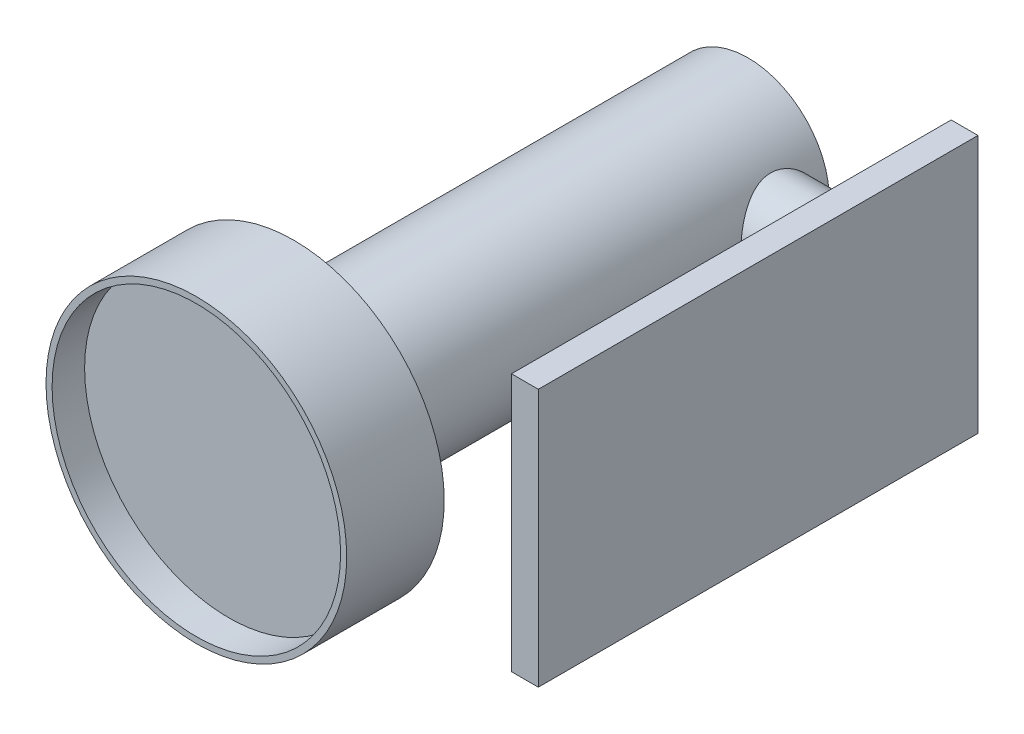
ISO-10303-21;
HEADER;
FILE_DESCRIPTION(('STEP AP214'),'2;1');
FILE_NAME('part.step','',(''),(''),'','','');
FILE_SCHEMA(('AUTOMOTIVE_DESIGN { 1 0 10303 214 1 1 1 1 }'));
ENDSEC;
DATA;
#1=APPLICATION_CONTEXT('core data for automotive mechanical design processes');
#2=APPLICATION_PROTOCOL_DEFINITION('international standard','automotive_design',2000,#1);
#3=PRODUCT_CONTEXT('',#1,'mechanical');
#4=PRODUCT('Part','Part','',(#3));
#5=PRODUCT_RELATED_PRODUCT_CATEGORY('part','',(#4));
#6=PRODUCT_DEFINITION_FORMATION('','',#4);
#7=PRODUCT_DEFINITION_CONTEXT('part definition',#1,'design');
#8=PRODUCT_DEFINITION('design','',#6,#7);
#9=PRODUCT_DEFINITION_SHAPE('','',#8);
#10=(LENGTH_UNIT() NAMED_UNIT(*) SI_UNIT(.MILLI.,.METRE.));
#11=(NAMED_UNIT(*) PLANE_ANGLE_UNIT() SI_UNIT($,.RADIAN.));
#12=(NAMED_UNIT(*) SI_UNIT($,.STERADIAN.) SOLID_ANGLE_UNIT());
#13=UNCERTAINTY_MEASURE_WITH_UNIT(LENGTH_MEASURE(1.E-05),#10,'distance_accuracy_value','');
#14=(GEOMETRIC_REPRESENTATION_CONTEXT(3) GLOBAL_UNCERTAINTY_ASSIGNED_CONTEXT((#13)) GLOBAL_UNIT_ASSIGNED_CONTEXT((#10,
#11,#12)) REPRESENTATION_CONTEXT('',''));
#15=CARTESIAN_POINT('',(0.,0.,0.));
#16=DIRECTION('',(0.,0.,1.));
#17=DIRECTION('',(1.,0.,0.));
#18=AXIS2_PLACEMENT_3D('',#15,#16,#17);
#19=CARTESIAN_POINT('',(0.,0.,-55.88));
#20=DIRECTION('',(0.,0.,1.));
#21=DIRECTION('',(1.,0.,0.));
#22=AXIS2_PLACEMENT_3D('',#19,#20,#21);
#23=CYLINDRICAL_SURFACE('',#22,10.);
#24=CARTESIAN_POINT('',(0.,0.,-55.88));
#25=DIRECTION('',(0.,0.,-1.));
#26=DIRECTION('',(-1.,0.,0.));
#27=AXIS2_PLACEMENT_3D('',#24,#25,#26);
#28=CIRCLE('',#27,10.);
#29=CARTESIAN_POINT('',(-10.,0.,-55.88));
#30=VERTEX_POINT('',#29);
#31=EDGE_CURVE('E125',#30,#30,#28,.T.);
#32=ORIENTED_EDGE('',*,*,#31,.F.);
#33=EDGE_LOOP('',(#32));
#34=FACE_BOUND('',#33,.T.);
#35=CARTESIAN_POINT('',(0.,0.,0.));
#36=DIRECTION('',(0.,0.,-1.));
#37=DIRECTION('',(-1.,0.,0.));
#38=AXIS2_PLACEMENT_3D('',#35,#36,#37);
#39=CIRCLE('',#38,10.);
#40=CARTESIAN_POINT('',(-10.,0.,0.));
#41=VERTEX_POINT('',#40);
#42=EDGE_CURVE('E53',#41,#41,#39,.T.);
#43=ORIENTED_EDGE('',*,*,#42,.T.);
#44=EDGE_LOOP('',(#43));
#45=FACE_BOUND('',#44,.T.);
#46=CARTESIAN_POINT('',(10.,0.,-55.0046272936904));
#47=CARTESIAN_POINT('',(9.99999960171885,0.131488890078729,-55.0046268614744));
#48=CARTESIAN_POINT('',(9.99740053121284,0.262986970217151,-54.9994345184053));
#49=CARTESIAN_POINT('',(9.98706977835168,0.525014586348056,-54.9787243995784));
#50=CARTESIAN_POINT('',(9.97933586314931,0.655543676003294,-54.9632021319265));
#51=CARTESIAN_POINT('',(9.95892066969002,0.914783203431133,-54.9219865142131));
#52=CARTESIAN_POINT('',(9.94623233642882,1.04349077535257,-54.8962786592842));
#53=CARTESIAN_POINT('',(9.91622716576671,1.29802636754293,-54.834976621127));
#54=CARTESIAN_POINT('',(9.89890843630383,1.42385318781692,-54.7993783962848));
#55=CARTESIAN_POINT('',(9.86015430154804,1.67121386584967,-54.7188488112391));
#56=CARTESIAN_POINT('',(9.83873709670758,1.79276399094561,-54.6739586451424));
#57=CARTESIAN_POINT('',(9.79224427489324,2.0314444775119,-54.5751784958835));
#58=CARTESIAN_POINT('',(9.7671672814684,2.14857315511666,-54.521285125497));
#59=CARTESIAN_POINT('',(9.68730860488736,2.49222561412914,-54.3468276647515));
#60=CARTESIAN_POINT('',(9.6278546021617,2.71128846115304,-54.2133965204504));
#61=CARTESIAN_POINT('',(9.49780663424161,3.13758045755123,-53.9070220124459));
#62=CARTESIAN_POINT('',(9.42675632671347,3.34329192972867,-53.7321766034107));
#63=CARTESIAN_POINT('',(9.28300214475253,3.72388133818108,-53.3520382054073));
#64=CARTESIAN_POINT('',(9.21029705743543,3.89873577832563,-53.1467222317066));
#65=CARTESIAN_POINT('',(9.06493867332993,4.22628385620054,-52.6921521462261));
#66=CARTESIAN_POINT('',(8.99272664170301,4.37620734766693,-52.4407254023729));
#67=CARTESIAN_POINT('',(8.89637417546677,4.56723365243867,-52.0447092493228));
#68=CARTESIAN_POINT('',(8.86624279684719,4.62527981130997,-51.9095090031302));
#69=CARTESIAN_POINT('',(8.81109611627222,4.72948843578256,-51.6336260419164));
#70=CARTESIAN_POINT('',(8.78607778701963,4.77565793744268,-51.4929466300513));
#71=CARTESIAN_POINT('',(8.74350562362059,4.85313805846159,-51.2156345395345));
#72=CARTESIAN_POINT('',(8.72559704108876,4.88516762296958,-51.0792568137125));
#73=CARTESIAN_POINT('',(8.69596333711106,4.93772573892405,-50.8037015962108));
#74=CARTESIAN_POINT('',(8.68423493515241,4.95826039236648,-50.6645256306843));
#75=CARTESIAN_POINT('',(8.66746161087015,4.98752398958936,-50.3846198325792));
#76=CARTESIAN_POINT('',(8.66241266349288,4.99626004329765,-50.2438909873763));
#77=CARTESIAN_POINT('',(8.65921299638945,5.00180399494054,-49.9621261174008));
#78=CARTESIAN_POINT('',(8.66106161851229,4.99861303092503,-49.8210901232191));
#79=CARTESIAN_POINT('',(8.67093727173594,4.98145803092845,-49.5569237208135));
#80=CARTESIAN_POINT('',(8.67819663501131,4.96883208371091,-49.4336746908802));
#81=CARTESIAN_POINT('',(8.69773906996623,4.93454402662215,-49.1888060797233));
#82=CARTESIAN_POINT('',(8.71002371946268,4.91287907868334,-49.0671870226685));
#83=CARTESIAN_POINT('',(8.73921479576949,4.86076278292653,-48.8264294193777));
#84=CARTESIAN_POINT('',(8.75612065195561,4.83031251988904,-48.7072905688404));
#85=CARTESIAN_POINT('',(8.79403073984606,4.76094319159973,-48.472155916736));
#86=CARTESIAN_POINT('',(8.81503658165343,4.72202079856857,-48.3561613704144));
#87=CARTESIAN_POINT('',(8.88436032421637,4.59108661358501,-48.0086204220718));
#88=CARTESIAN_POINT('',(8.93828791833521,4.48608785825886,-47.7829339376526));
#89=CARTESIAN_POINT('',(9.05517433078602,4.24519591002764,-47.3514171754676));
#90=CARTESIAN_POINT('',(9.11813720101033,4.10928884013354,-47.1455958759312));
#91=CARTESIAN_POINT('',(9.2556545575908,3.79034422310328,-46.7320387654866));
#92=CARTESIAN_POINT('',(9.33066654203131,3.60351571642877,-46.5273692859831));
#93=CARTESIAN_POINT('',(9.47739013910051,3.19773444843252,-46.1509238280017));
#94=CARTESIAN_POINT('',(9.54910016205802,2.97876642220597,-45.9791635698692));
#95=CARTESIAN_POINT('',(9.65034506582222,2.62430600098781,-45.7461863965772));
#96=CARTESIAN_POINT('',(9.68370380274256,2.49871002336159,-45.6712751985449));
#97=CARTESIAN_POINT('',(9.74663052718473,2.2407106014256,-45.532419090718));
#98=CARTESIAN_POINT('',(9.77620011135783,2.10831005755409,-45.4684695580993));
#99=CARTESIAN_POINT('',(9.83067553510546,1.83762803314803,-45.352228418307));
#100=CARTESIAN_POINT('',(9.85558325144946,1.69934894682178,-45.2999321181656));
#101=CARTESIAN_POINT('',(9.89999026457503,1.41791187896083,-45.2076023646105));
#102=CARTESIAN_POINT('',(9.91949018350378,1.27475446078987,-45.1675675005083));
#103=CARTESIAN_POINT('',(9.95109597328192,0.996798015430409,-45.1030937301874));
#104=CARTESIAN_POINT('',(9.96368046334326,0.862288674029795,-45.077637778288));
#105=CARTESIAN_POINT('',(9.98343035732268,0.591248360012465,-45.0378192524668));
#106=CARTESIAN_POINT('',(9.99059624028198,0.45471756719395,-45.0234556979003));
#107=CARTESIAN_POINT('',(9.99930380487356,0.180810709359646,-45.0060141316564));
#108=CARTESIAN_POINT('',(10.000847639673,0.0434349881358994,-45.0029317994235));
#109=CARTESIAN_POINT('',(9.99827237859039,-0.23104760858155,-45.0080828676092));
#110=CARTESIAN_POINT('',(9.99415353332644,-0.36815449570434,-45.0163157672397));
#111=CARTESIAN_POINT('',(9.98090973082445,-0.630324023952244,-45.0429059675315));
#112=CARTESIAN_POINT('',(9.97219922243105,-0.755493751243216,-45.0604256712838));
#113=CARTESIAN_POINT('',(9.95027227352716,-1.00380426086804,-45.104801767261));
#114=CARTESIAN_POINT('',(9.93705440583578,-1.12694438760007,-45.1316611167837));
#115=CARTESIAN_POINT('',(9.90642450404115,-1.37032307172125,-45.1944299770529));
#116=CARTESIAN_POINT('',(9.88901375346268,-1.49056250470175,-45.2303367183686));
#117=CARTESIAN_POINT('',(9.85039368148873,-1.72747946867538,-45.3108554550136));
#118=CARTESIAN_POINT('',(9.82918290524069,-1.84415561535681,-45.3554707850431));
#119=CARTESIAN_POINT('',(9.75922876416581,-2.19430354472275,-45.5045751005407));
#120=CARTESIAN_POINT('',(9.70504904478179,-2.42111320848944,-45.6225680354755));
#121=CARTESIAN_POINT('',(9.58719375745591,-2.8523456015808,-45.8901794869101));
#122=CARTESIAN_POINT('',(9.5235141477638,-3.05675873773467,-46.0398114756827));
#123=CARTESIAN_POINT('',(9.38541505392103,-3.45882132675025,-46.3834145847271));
#124=CARTESIAN_POINT('',(9.31055499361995,-3.65383533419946,-46.5802968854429));
#125=CARTESIAN_POINT('',(9.16310881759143,-4.00930667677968,-47.0042978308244));
#126=CARTESIAN_POINT('',(9.09052430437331,-4.16974010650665,-47.2314372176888));
#127=CARTESIAN_POINT('',(8.98785260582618,-4.38466016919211,-47.5971178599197));
#128=CARTESIAN_POINT('',(8.95395955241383,-4.4532676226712,-47.7264781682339));
#129=CARTESIAN_POINT('',(8.89022352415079,-4.57918112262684,-47.9915213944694));
#130=CARTESIAN_POINT('',(8.86037871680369,-4.63649228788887,-48.1272014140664));
#131=CARTESIAN_POINT('',(8.80590327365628,-4.73913999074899,-48.4039043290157));
#132=CARTESIAN_POINT('',(8.78126837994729,-4.78448631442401,-48.5449227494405));
#133=CARTESIAN_POINT('',(8.73822819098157,-4.86265004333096,-48.8313183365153));
#134=CARTESIAN_POINT('',(8.7198219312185,-4.89546938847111,-48.976694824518));
#135=CARTESIAN_POINT('',(8.69151275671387,-4.94553834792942,-49.2563922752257));
#136=CARTESIAN_POINT('',(8.6809632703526,-4.96397997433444,-49.3904351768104));
#137=CARTESIAN_POINT('',(8.66606824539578,-4.98993873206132,-49.6599125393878));
#138=CARTESIAN_POINT('',(8.66172205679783,-4.99745700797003,-49.7953468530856));
#139=CARTESIAN_POINT('',(8.65941425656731,-5.00145477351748,-50.0663842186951));
#140=CARTESIAN_POINT('',(8.66145040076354,-4.99793814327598,-50.20198719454));
#141=CARTESIAN_POINT('',(8.67181681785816,-4.97992974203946,-50.4722128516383));
#142=CARTESIAN_POINT('',(8.68014683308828,-4.96543842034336,-50.606835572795));
#143=CARTESIAN_POINT('',(8.70167828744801,-4.92759757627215,-50.8611874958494));
#144=CARTESIAN_POINT('',(8.71433770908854,-4.90522766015,-50.9811098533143));
#145=CARTESIAN_POINT('',(8.74411599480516,-4.85194376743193,-51.2184884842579));
#146=CARTESIAN_POINT('',(8.76123623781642,-4.82102714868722,-51.3359439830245));
#147=CARTESIAN_POINT('',(8.81854231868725,-4.71590306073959,-51.6835444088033));
#148=CARTESIAN_POINT('',(8.86468813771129,-4.62929708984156,-51.9090833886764));
#149=CARTESIAN_POINT('',(8.97142890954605,-4.41907164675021,-52.3577876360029));
#150=CARTESIAN_POINT('',(9.03278633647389,-4.29335633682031,-52.5797753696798));
#151=CARTESIAN_POINT('',(9.1617663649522,-4.01075421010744,-53.0009914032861));
#152=CARTESIAN_POINT('',(9.22939221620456,-3.85385117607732,-53.2002077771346));
#153=CARTESIAN_POINT('',(9.37311444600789,-3.49102748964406,-53.5953351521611));
#154=CARTESIAN_POINT('',(9.44924162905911,-3.28146736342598,-53.787903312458));
#155=CARTESIAN_POINT('',(9.59389514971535,-2.83072875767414,-54.1359617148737));
#156=CARTESIAN_POINT('',(9.66241737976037,-2.58953334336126,-54.291431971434));
#157=CARTESIAN_POINT('',(9.7541901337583,-2.20753881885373,-54.4932577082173));
#158=CARTESIAN_POINT('',(9.78304209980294,-2.0762551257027,-54.5554943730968));
#159=CARTESIAN_POINT('',(9.83614745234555,-1.80799529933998,-54.6685634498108));
#160=CARTESIAN_POINT('',(9.8604030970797,-1.67102200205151,-54.719401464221));
#161=CARTESIAN_POINT('',(9.90354484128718,-1.39269501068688,-54.8089727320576));
#162=CARTESIAN_POINT('',(9.92244264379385,-1.25135162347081,-54.8477323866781));
#163=CARTESIAN_POINT('',(9.95434618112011,-0.965237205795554,-54.912764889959));
#164=CARTESIAN_POINT('',(9.96735551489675,-0.82046832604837,-54.9390453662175));
#165=CARTESIAN_POINT('',(9.98476387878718,-0.563041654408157,-54.9741018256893));
#166=CARTESIAN_POINT('',(9.99046741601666,-0.450825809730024,-54.9855390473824));
#167=CARTESIAN_POINT('',(9.99808569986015,-0.225742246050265,-55.0008020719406));
#168=CARTESIAN_POINT('',(10.000000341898,-0.112874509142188,-55.0046276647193));
#169=CARTESIAN_POINT('',(10.,0.,-55.0046272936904));
#170=B_SPLINE_CURVE_WITH_KNOTS('',3,(#46,#47,#48,#49,#50,#51,#52,#53,#54,#55,#56,#57,#58,#59,
#60,#61,#62,#63,#64,#65,#66,#67,#68,#69,#70,#71,#72,#73,#74,#75,#76,#77,#78,#79,#80,#81,#82,#83,
#84,#85,#86,#87,#88,#89,#90,#91,#92,#93,#94,#95,#96,#97,#98,#99,#100,#101,#102,#103,#104,#105,
#106,#107,#108,#109,#110,#111,#112,#113,#114,#115,#116,#117,#118,#119,#120,#121,#122,#123,#124,
#125,#126,#127,#128,#129,#130,#131,#132,#133,#134,#135,#136,#137,#138,#139,#140,#141,#142,#143,
#144,#145,#146,#147,#148,#149,#150,#151,#152,#153,#154,#155,#156,#157,#158,#159,#160,#161,#162,
#163,#164,#165,#166,#167,#168,#169),.UNSPECIFIED.,.T.,.F.,(4,2,2,2,2,2,2,2,2,2,2,2,2,2,2,2,2,2,
2,2,2,2,2,2,2,2,2,2,2,2,2,2,2,2,2,2,2,2,2,2,2,2,2,2,2,2,2,2,2,2,2,2,2,2,2,2,2,2,2,2,2,4),(0.,
0.39435529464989,0.788882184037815,1.18397293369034,1.57922537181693,1.97276168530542,
2.36644639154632,3.15295441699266,3.98704440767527,4.821766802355,5.72122193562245,
6.17125359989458,6.62101803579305,7.04410338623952,7.46696393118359,7.88956954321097,
8.3121348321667,8.68401534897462,9.05601271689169,9.42796417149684,9.80006198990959,
10.56083380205,11.3219478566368,12.1795688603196,13.03759852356,13.4870830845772,
13.9363776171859,14.3854908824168,14.8345524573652,15.2464230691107,15.6582572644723,
16.0699337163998,16.4815919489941,16.8612200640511,17.240968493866,17.6206008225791,
18.0003788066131,18.7808755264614,19.5617052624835,20.4192132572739,21.2773121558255,
21.7277011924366,22.1778856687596,22.6277007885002,23.0774462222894,23.4840267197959,
23.8905646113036,24.2969595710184,24.703337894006,25.0708552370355,25.4384863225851,
26.1732662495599,26.9574126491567,27.7419678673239,28.6218519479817,29.5022089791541,
29.9460734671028,30.3897193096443,30.8323885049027,31.2747867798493,31.6133053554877,
31.9518332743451),.UNSPECIFIED.);
#171=CARTESIAN_POINT('',(10.,0.,-55.0046272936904));
#172=VERTEX_POINT('',#171);
#173=EDGE_CURVE('E11',#172,#172,#170,.T.);
#174=ORIENTED_EDGE('',*,*,#173,.F.);
#175=EDGE_LOOP('',(#174));
#176=FACE_BOUND('',#175,.T.);
#177=ADVANCED_FACE('F39',(#34,#45,#176),#23,.T.);
#178=CARTESIAN_POINT('',(0.,0.,12.));
#179=DIRECTION('',(0.,0.,-1.));
#180=DIRECTION('',(-1.,0.,0.));
#181=AXIS2_PLACEMENT_3D('',#178,#179,#180);
#182=CYLINDRICAL_SURFACE('',#181,18.5);
#183=CARTESIAN_POINT('',(0.,0.,12.));
#184=DIRECTION('',(0.,0.,1.));
#185=DIRECTION('',(1.,0.,0.));
#186=AXIS2_PLACEMENT_3D('',#183,#184,#185);
#187=CIRCLE('',#186,18.5);
#188=CARTESIAN_POINT('',(18.5,0.,12.));
#189=VERTEX_POINT('',#188);
#190=EDGE_CURVE('E131',#189,#189,#187,.T.);
#191=ORIENTED_EDGE('',*,*,#190,.F.);
#192=EDGE_LOOP('',(#191));
#193=FACE_BOUND('',#192,.T.);
#194=CARTESIAN_POINT('',(0.,0.,0.));
#195=DIRECTION('',(0.,0.,1.));
#196=DIRECTION('',(1.,0.,0.));
#197=AXIS2_PLACEMENT_3D('',#194,#195,#196);
#198=CIRCLE('',#197,18.5);
#199=CARTESIAN_POINT('',(18.5,0.,0.));
#200=VERTEX_POINT('',#199);
#201=EDGE_CURVE('E135',#200,#200,#198,.T.);
#202=ORIENTED_EDGE('',*,*,#201,.T.);
#203=EDGE_LOOP('',(#202));
#204=FACE_BOUND('',#203,.T.);
#205=ADVANCED_FACE('F41',(#193,#204),#182,.T.);
#206=CARTESIAN_POINT('',(0.,0.,12.));
#207=DIRECTION('',(0.,0.,1.));
#208=DIRECTION('',(1.,0.,0.));
#209=AXIS2_PLACEMENT_3D('',#206,#207,#208);
#210=PLANE('',#209);
#211=CARTESIAN_POINT('',(0.,0.,12.));
#212=DIRECTION('',(0.,0.,1.));
#213=DIRECTION('',(1.,0.,0.));
#214=AXIS2_PLACEMENT_3D('',#211,#212,#213);
#215=CIRCLE('',#214,17.75);
#216=CARTESIAN_POINT('',(17.75,0.,12.));
#217=VERTEX_POINT('',#216);
#218=EDGE_CURVE('E128',#217,#217,#215,.T.);
#219=ORIENTED_EDGE('',*,*,#218,.F.);
#220=EDGE_LOOP('',(#219));
#221=FACE_BOUND('',#220,.T.);
#222=ORIENTED_EDGE('',*,*,#190,.T.);
#223=EDGE_LOOP('',(#222));
#224=FACE_BOUND('',#223,.T.);
#225=ADVANCED_FACE('F146',(#221,#224),#210,.T.);
#226=CARTESIAN_POINT('',(0.,0.,0.));
#227=DIRECTION('',(0.,0.,1.));
#228=DIRECTION('',(1.,0.,0.));
#229=AXIS2_PLACEMENT_3D('',#226,#227,#228);
#230=PLANE('',#229);
#231=ORIENTED_EDGE('',*,*,#42,.F.);
#232=EDGE_LOOP('',(#231));
#233=FACE_BOUND('',#232,.T.);
#234=ORIENTED_EDGE('',*,*,#201,.F.);
#235=EDGE_LOOP('',(#234));
#236=FACE_BOUND('',#235,.T.);
#237=ADVANCED_FACE('F143',(#233,#236),#230,.F.);
#238=CARTESIAN_POINT('',(0.,0.,8.));
#239=DIRECTION('',(0.,0.,1.));
#240=DIRECTION('',(1.,0.,0.));
#241=AXIS2_PLACEMENT_3D('',#238,#239,#240);
#242=CYLINDRICAL_SURFACE('',#241,17.75);
#243=CARTESIAN_POINT('',(0.,0.,8.));
#244=DIRECTION('',(0.,0.,1.));
#245=DIRECTION('',(1.,0.,0.));
#246=AXIS2_PLACEMENT_3D('',#243,#244,#245);
#247=CIRCLE('',#246,17.75);
#248=CARTESIAN_POINT('',(17.75,0.,8.));
#249=VERTEX_POINT('',#248);
#250=EDGE_CURVE('E132',#249,#249,#247,.T.);
#251=ORIENTED_EDGE('',*,*,#250,.F.);
#252=EDGE_LOOP('',(#251));
#253=FACE_BOUND('',#252,.T.);
#254=ORIENTED_EDGE('',*,*,#218,.T.);
#255=EDGE_LOOP('',(#254));
#256=FACE_BOUND('',#255,.T.);
#257=ADVANCED_FACE('F145',(#253,#256),#242,.F.);
#258=CARTESIAN_POINT('',(0.,0.,8.));
#259=DIRECTION('',(0.,0.,1.));
#260=DIRECTION('',(1.,0.,0.));
#261=AXIS2_PLACEMENT_3D('',#258,#259,#260);
#262=PLANE('',#261);
#263=ORIENTED_EDGE('',*,*,#250,.T.);
#264=EDGE_LOOP('',(#263));
#265=FACE_BOUND('',#264,.T.);
#266=ADVANCED_FACE('F153',(#265),#262,.T.);
#267=CARTESIAN_POINT('',(0.,0.,-55.88));
#268=DIRECTION('',(0.,0.,-1.));
#269=DIRECTION('',(-1.,0.,0.));
#270=AXIS2_PLACEMENT_3D('',#267,#268,#269);
#271=PLANE('',#270);
#272=ORIENTED_EDGE('',*,*,#31,.T.);
#273=EDGE_LOOP('',(#272));
#274=FACE_BOUND('',#273,.T.);
#275=ADVANCED_FACE('F172',(#274),#271,.T.);
#276=CARTESIAN_POINT('',(25.,0.,-50.0046272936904));
#277=DIRECTION('',(-1.,0.,0.));
#278=DIRECTION('',(0.,0.,1.));
#279=AXIS2_PLACEMENT_3D('',#276,#277,#278);
#280=CYLINDRICAL_SURFACE('',#279,5.);
#281=CARTESIAN_POINT('',(25.,0.,-50.0046272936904));
#282=DIRECTION('',(1.,0.,0.));
#283=DIRECTION('',(0.,0.,-1.));
#284=AXIS2_PLACEMENT_3D('',#281,#282,#283);
#285=CIRCLE('',#284,5.);
#286=CARTESIAN_POINT('',(25.,0.,-55.0046272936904));
#287=VERTEX_POINT('',#286);
#288=EDGE_CURVE('E122',#287,#287,#285,.T.);
#289=ORIENTED_EDGE('',*,*,#288,.F.);
#290=EDGE_LOOP('',(#289));
#291=FACE_BOUND('',#290,.T.);
#292=ORIENTED_EDGE('',*,*,#173,.T.);
#293=EDGE_LOOP('',(#292));
#294=FACE_BOUND('',#293,.T.);
#295=ADVANCED_FACE('F176',(#291,#294),#280,.T.);
#296=CARTESIAN_POINT('',(28.302,0.,-55.88));
#297=DIRECTION('',(0.,0.,1.));
#298=DIRECTION('',(1.,0.,0.));
#299=AXIS2_PLACEMENT_3D('',#296,#297,#298);
#300=PLANE('',#299);
#301=DIRECTION('',(0.,1.,0.));
#302=VECTOR('',#301,1.);
#303=CARTESIAN_POINT('',(25.,0.,-55.88));
#304=LINE('',#303,#302);
#305=CARTESIAN_POINT('',(25.,-15.875,-55.88));
#306=VERTEX_POINT('',#305);
#307=CARTESIAN_POINT('',(25.,15.875,-55.88));
#308=VERTEX_POINT('',#307);
#309=EDGE_CURVE('E85',#306,#308,#304,.T.);
#310=ORIENTED_EDGE('',*,*,#309,.T.);
#311=DIRECTION('',(-1.,0.,0.));
#312=VECTOR('',#311,1.);
#313=CARTESIAN_POINT('',(28.302,15.875,-55.88));
#314=LINE('',#313,#312);
#315=CARTESIAN_POINT('',(28.302,15.875,-55.88));
#316=VERTEX_POINT('',#315);
#317=EDGE_CURVE('E104',#316,#308,#314,.T.);
#318=ORIENTED_EDGE('',*,*,#317,.F.);
#319=DIRECTION('',(0.,1.,0.));
#320=VECTOR('',#319,1.);
#321=CARTESIAN_POINT('',(28.302,-15.875,-55.88));
#322=LINE('',#321,#320);
#323=CARTESIAN_POINT('',(28.302,-15.875,-55.88));
#324=VERTEX_POINT('',#323);
#325=EDGE_CURVE('E90',#324,#316,#322,.T.);
#326=ORIENTED_EDGE('',*,*,#325,.F.);
#327=DIRECTION('',(-1.,0.,0.));
#328=VECTOR('',#327,1.);
#329=CARTESIAN_POINT('',(28.302,-15.875,-55.88));
#330=LINE('',#329,#328);
#331=EDGE_CURVE('E109',#324,#306,#330,.T.);
#332=ORIENTED_EDGE('',*,*,#331,.T.);
#333=EDGE_LOOP('',(#310,#318,#326,#332));
#334=FACE_BOUND('',#333,.T.);
#335=ADVANCED_FACE('F185',(#334),#300,.F.);
#336=CARTESIAN_POINT('',(28.302,15.875,-55.88));
#337=DIRECTION('',(0.,-1.,0.));
#338=DIRECTION('',(0.,0.,-1.));
#339=AXIS2_PLACEMENT_3D('',#336,#337,#338);
#340=PLANE('',#339);
#341=DIRECTION('',(0.,0.,1.));
#342=VECTOR('',#341,1.);
#343=CARTESIAN_POINT('',(25.,15.875,-55.88));
#344=LINE('',#343,#342);
#345=CARTESIAN_POINT('',(25.,15.875,-1.77800000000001));
#346=VERTEX_POINT('',#345);
#347=EDGE_CURVE('E103',#308,#346,#344,.T.);
#348=ORIENTED_EDGE('',*,*,#347,.T.);
#349=DIRECTION('',(-1.,0.,0.));
#350=VECTOR('',#349,1.);
#351=CARTESIAN_POINT('',(28.302,15.875,-1.77800000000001));
#352=LINE('',#351,#350);
#353=CARTESIAN_POINT('',(28.302,15.875,-1.77800000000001));
#354=VERTEX_POINT('',#353);
#355=EDGE_CURVE('E101',#354,#346,#352,.T.);
#356=ORIENTED_EDGE('',*,*,#355,.F.);
#357=DIRECTION('',(0.,0.,1.));
#358=VECTOR('',#357,1.);
#359=CARTESIAN_POINT('',(28.302,15.875,-55.88));
#360=LINE('',#359,#358);
#361=EDGE_CURVE('E93',#316,#354,#360,.T.);
#362=ORIENTED_EDGE('',*,*,#361,.F.);
#363=ORIENTED_EDGE('',*,*,#317,.T.);
#364=EDGE_LOOP('',(#348,#356,#362,#363));
#365=FACE_BOUND('',#364,.T.);
#366=ADVANCED_FACE('F102',(#365),#340,.F.);
#367=CARTESIAN_POINT('',(28.302,15.875,-1.77800000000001));
#368=DIRECTION('',(0.,0.,-1.));
#369=DIRECTION('',(0.,1.,0.));
#370=AXIS2_PLACEMENT_3D('',#367,#368,#369);
#371=PLANE('',#370);
#372=DIRECTION('',(0.,-1.,0.));
#373=VECTOR('',#372,1.);
#374=CARTESIAN_POINT('',(25.,15.875,-1.77800000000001));
#375=LINE('',#374,#373);
#376=CARTESIAN_POINT('',(25.,-15.875,-1.77800000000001));
#377=VERTEX_POINT('',#376);
#378=EDGE_CURVE('E78',#346,#377,#375,.T.);
#379=ORIENTED_EDGE('',*,*,#378,.T.);
#380=DIRECTION('',(-1.,0.,0.));
#381=VECTOR('',#380,1.);
#382=CARTESIAN_POINT('',(28.302,-15.875,-1.77800000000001));
#383=LINE('',#382,#381);
#384=CARTESIAN_POINT('',(28.302,-15.875,-1.77800000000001));
#385=VERTEX_POINT('',#384);
#386=EDGE_CURVE('E105',#385,#377,#383,.T.);
#387=ORIENTED_EDGE('',*,*,#386,.F.);
#388=DIRECTION('',(0.,-1.,0.));
#389=VECTOR('',#388,1.);
#390=CARTESIAN_POINT('',(28.302,15.875,-1.77800000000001));
#391=LINE('',#390,#389);
#392=EDGE_CURVE('E97',#354,#385,#391,.T.);
#393=ORIENTED_EDGE('',*,*,#392,.F.);
#394=ORIENTED_EDGE('',*,*,#355,.T.);
#395=EDGE_LOOP('',(#379,#387,#393,#394));
#396=FACE_BOUND('',#395,.T.);
#397=ADVANCED_FACE('F107',(#396),#371,.F.);
#398=CARTESIAN_POINT('',(28.302,-15.875,-1.77800000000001));
#399=DIRECTION('',(0.,1.,0.));
#400=DIRECTION('',(0.,0.,1.));
#401=AXIS2_PLACEMENT_3D('',#398,#399,#400);
#402=PLANE('',#401);
#403=DIRECTION('',(0.,0.,-1.));
#404=VECTOR('',#403,1.);
#405=CARTESIAN_POINT('',(25.,-15.875,-1.77800000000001));
#406=LINE('',#405,#404);
#407=EDGE_CURVE('E116',#377,#306,#406,.T.);
#408=ORIENTED_EDGE('',*,*,#407,.T.);
#409=ORIENTED_EDGE('',*,*,#331,.F.);
#410=DIRECTION('',(0.,0.,-1.));
#411=VECTOR('',#410,1.);
#412=CARTESIAN_POINT('',(28.302,-15.875,-1.77800000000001));
#413=LINE('',#412,#411);
#414=EDGE_CURVE('E61',#385,#324,#413,.T.);
#415=ORIENTED_EDGE('',*,*,#414,.F.);
#416=ORIENTED_EDGE('',*,*,#386,.T.);
#417=EDGE_LOOP('',(#408,#409,#415,#416));
#418=FACE_BOUND('',#417,.T.);
#419=ADVANCED_FACE('F200',(#418),#402,.F.);
#420=CARTESIAN_POINT('',(28.302,0.,0.));
#421=DIRECTION('',(1.,0.,0.));
#422=DIRECTION('',(0.,0.,-1.));
#423=AXIS2_PLACEMENT_3D('',#420,#421,#422);
#424=PLANE('',#423);
#425=ORIENTED_EDGE('',*,*,#325,.T.);
#426=ORIENTED_EDGE('',*,*,#361,.T.);
#427=ORIENTED_EDGE('',*,*,#392,.T.);
#428=ORIENTED_EDGE('',*,*,#414,.T.);
#429=EDGE_LOOP('',(#425,#426,#427,#428));
#430=FACE_BOUND('',#429,.T.);
#431=ADVANCED_FACE('F95',(#430),#424,.T.);
#432=CARTESIAN_POINT('',(25.,0.,0.));
#433=DIRECTION('',(1.,0.,0.));
#434=DIRECTION('',(0.,0.,-1.));
#435=AXIS2_PLACEMENT_3D('',#432,#433,#434);
#436=PLANE('',#435);
#437=ORIENTED_EDGE('',*,*,#288,.T.);
#438=EDGE_LOOP('',(#437));
#439=FACE_BOUND('',#438,.T.);
#440=ORIENTED_EDGE('',*,*,#309,.F.);
#441=ORIENTED_EDGE('',*,*,#407,.F.);
#442=ORIENTED_EDGE('',*,*,#378,.F.);
#443=ORIENTED_EDGE('',*,*,#347,.F.);
#444=EDGE_LOOP('',(#440,#441,#442,#443));
#445=FACE_BOUND('',#444,.T.);
#446=ADVANCED_FACE('F204',(#439,#445),#436,.F.);
#447=CLOSED_SHELL('',(#177,#205,#225,#237,#257,#266,#275,#295,#335,#366,#397,#419,#431,#446));
#448=MANIFOLD_SOLID_BREP('B2',#447);
#449=ADVANCED_BREP_SHAPE_REPRESENTATION('',(#18,#448),#14);
#450=SHAPE_DEFINITION_REPRESENTATION(#9,#449);
ENDSEC;
END-ISO-10303-21;
